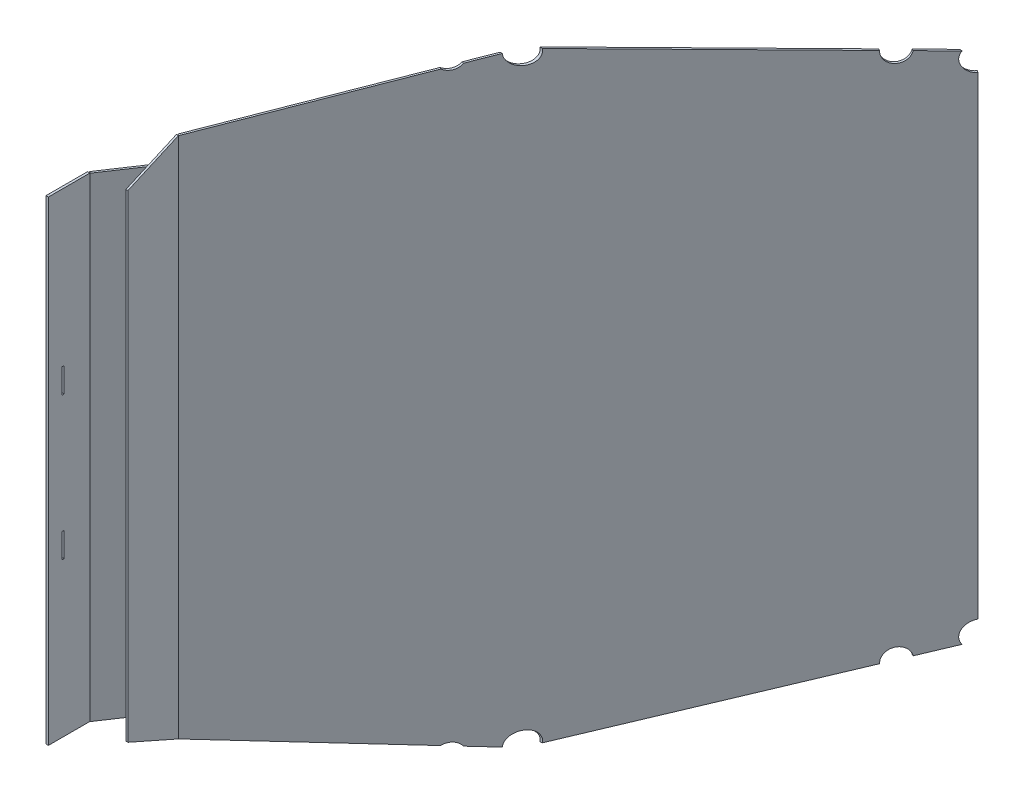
ISO-10303-21;
HEADER;
FILE_DESCRIPTION(('STEP AP214'),'2;1');
FILE_NAME('part.step','',(''),(''),'','','');
FILE_SCHEMA(('AUTOMOTIVE_DESIGN { 1 0 10303 214 1 1 1 1 }'));
ENDSEC;
DATA;
#1=APPLICATION_CONTEXT('core data for automotive mechanical design processes');
#2=APPLICATION_PROTOCOL_DEFINITION('international standard','automotive_design',2000,#1);
#3=PRODUCT_CONTEXT('',#1,'mechanical');
#4=PRODUCT('Part','Part','',(#3));
#5=PRODUCT_RELATED_PRODUCT_CATEGORY('part','',(#4));
#6=PRODUCT_DEFINITION_FORMATION('','',#4);
#7=PRODUCT_DEFINITION_CONTEXT('part definition',#1,'design');
#8=PRODUCT_DEFINITION('design','',#6,#7);
#9=PRODUCT_DEFINITION_SHAPE('','',#8);
#10=(LENGTH_UNIT() NAMED_UNIT(*) SI_UNIT(.MILLI.,.METRE.));
#11=(NAMED_UNIT(*) PLANE_ANGLE_UNIT() SI_UNIT($,.RADIAN.));
#12=(NAMED_UNIT(*) SI_UNIT($,.STERADIAN.) SOLID_ANGLE_UNIT());
#13=UNCERTAINTY_MEASURE_WITH_UNIT(LENGTH_MEASURE(1.E-05),#10,'distance_accuracy_value','');
#14=(GEOMETRIC_REPRESENTATION_CONTEXT(3) GLOBAL_UNCERTAINTY_ASSIGNED_CONTEXT((#13)) GLOBAL_UNIT_ASSIGNED_CONTEXT((#10,
#11,#12)) REPRESENTATION_CONTEXT('',''));
#15=CARTESIAN_POINT('',(0.,0.,0.));
#16=DIRECTION('',(0.,0.,1.));
#17=DIRECTION('',(1.,0.,0.));
#18=AXIS2_PLACEMENT_3D('',#15,#16,#17);
#19=CARTESIAN_POINT('',(-27.94,254.,581.556410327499));
#20=DIRECTION('',(0.,1.,0.));
#21=DIRECTION('',(0.,0.,1.));
#22=AXIS2_PLACEMENT_3D('',#19,#20,#21);
#23=PLANE('',#22);
#24=DIRECTION('',(0.,0.,1.));
#25=VECTOR('',#24,1.);
#26=CARTESIAN_POINT('',(-25.4,254.,581.556410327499));
#27=LINE('',#26,#25);
#28=CARTESIAN_POINT('',(-25.4,254.,581.556410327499));
#29=VERTEX_POINT('',#28);
#30=CARTESIAN_POINT('',(-25.4,254.,626.006410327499));
#31=VERTEX_POINT('',#30);
#32=EDGE_CURVE('E207',#29,#31,#27,.T.);
#33=ORIENTED_EDGE('',*,*,#32,.F.);
#34=DIRECTION('',(1.,0.,0.));
#35=VECTOR('',#34,1.);
#36=CARTESIAN_POINT('',(-27.94,254.,581.556410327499));
#37=LINE('',#36,#35);
#38=CARTESIAN_POINT('',(-27.94,254.,581.556410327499));
#39=VERTEX_POINT('',#38);
#40=EDGE_CURVE('E12',#39,#29,#37,.T.);
#41=ORIENTED_EDGE('',*,*,#40,.F.);
#42=DIRECTION('',(0.,0.,1.));
#43=VECTOR('',#42,1.);
#44=CARTESIAN_POINT('',(-27.94,254.,581.556410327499));
#45=LINE('',#44,#43);
#46=CARTESIAN_POINT('',(-27.94,254.,626.006410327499));
#47=VERTEX_POINT('',#46);
#48=EDGE_CURVE('E214',#39,#47,#45,.T.);
#49=ORIENTED_EDGE('',*,*,#48,.T.);
#50=DIRECTION('',(1.,0.,0.));
#51=VECTOR('',#50,1.);
#52=CARTESIAN_POINT('',(-27.94,254.,626.006410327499));
#53=LINE('',#52,#51);
#54=EDGE_CURVE('E59',#47,#31,#53,.T.);
#55=ORIENTED_EDGE('',*,*,#54,.T.);
#56=EDGE_LOOP('',(#33,#41,#49,#55));
#57=FACE_BOUND('',#56,.T.);
#58=ADVANCED_FACE('F56',(#57),#23,.T.);
#59=CARTESIAN_POINT('',(-27.94,254.,581.556410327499));
#60=DIRECTION('',(0.,0.,-1.));
#61=DIRECTION('',(-1.,0.,0.));
#62=AXIS2_PLACEMENT_3D('',#59,#60,#61);
#63=PLANE('',#62);
#64=DIRECTION('',(0.,1.,0.));
#65=VECTOR('',#64,1.);
#66=CARTESIAN_POINT('',(-25.4,254.,581.556410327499));
#67=LINE('',#66,#65);
#68=CARTESIAN_POINT('',(-25.4,-254.,581.556410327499));
#69=VERTEX_POINT('',#68);
#70=EDGE_CURVE('E218',#69,#29,#67,.T.);
#71=ORIENTED_EDGE('',*,*,#70,.F.);
#72=DIRECTION('',(1.,0.,0.));
#73=VECTOR('',#72,1.);
#74=CARTESIAN_POINT('',(-27.94,-254.,581.556410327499));
#75=LINE('',#74,#73);
#76=CARTESIAN_POINT('',(-27.94,-254.,581.556410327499));
#77=VERTEX_POINT('',#76);
#78=EDGE_CURVE('E64',#77,#69,#75,.T.);
#79=ORIENTED_EDGE('',*,*,#78,.F.);
#80=DIRECTION('',(0.,1.,0.));
#81=VECTOR('',#80,1.);
#82=CARTESIAN_POINT('',(-27.94,254.,581.556410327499));
#83=LINE('',#82,#81);
#84=EDGE_CURVE('E224',#77,#39,#83,.T.);
#85=ORIENTED_EDGE('',*,*,#84,.T.);
#86=ORIENTED_EDGE('',*,*,#40,.T.);
#87=EDGE_LOOP('',(#71,#79,#85,#86));
#88=FACE_BOUND('',#87,.T.);
#89=ADVANCED_FACE('F250',(#88),#63,.T.);
#90=CARTESIAN_POINT('',(-27.94,-254.,581.556410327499));
#91=DIRECTION('',(0.,-1.,0.));
#92=DIRECTION('',(0.,0.,-1.));
#93=AXIS2_PLACEMENT_3D('',#90,#91,#92);
#94=PLANE('',#93);
#95=DIRECTION('',(0.,0.,-1.));
#96=VECTOR('',#95,1.);
#97=CARTESIAN_POINT('',(-25.4,-254.,581.556410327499));
#98=LINE('',#97,#96);
#99=CARTESIAN_POINT('',(-25.4,-254.,626.006410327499));
#100=VERTEX_POINT('',#99);
#101=EDGE_CURVE('E232',#100,#69,#98,.T.);
#102=ORIENTED_EDGE('',*,*,#101,.F.);
#103=DIRECTION('',(1.,0.,0.));
#104=VECTOR('',#103,1.);
#105=CARTESIAN_POINT('',(-27.94,-254.,626.006410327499));
#106=LINE('',#105,#104);
#107=CARTESIAN_POINT('',(-27.94,-254.,626.006410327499));
#108=VERTEX_POINT('',#107);
#109=EDGE_CURVE('E237',#108,#100,#106,.T.);
#110=ORIENTED_EDGE('',*,*,#109,.F.);
#111=DIRECTION('',(0.,0.,-1.));
#112=VECTOR('',#111,1.);
#113=CARTESIAN_POINT('',(-27.94,-254.,581.556410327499));
#114=LINE('',#113,#112);
#115=EDGE_CURVE('E221',#108,#77,#114,.T.);
#116=ORIENTED_EDGE('',*,*,#115,.T.);
#117=ORIENTED_EDGE('',*,*,#78,.T.);
#118=EDGE_LOOP('',(#102,#110,#116,#117));
#119=FACE_BOUND('',#118,.T.);
#120=ADVANCED_FACE('F255',(#119),#94,.T.);
#121=CARTESIAN_POINT('',(-27.94,254.,626.006410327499));
#122=DIRECTION('',(0.,0.,1.));
#123=DIRECTION('',(0.,-1.,0.));
#124=AXIS2_PLACEMENT_3D('',#121,#122,#123);
#125=PLANE('',#124);
#126=DIRECTION('',(0.,-1.,0.));
#127=VECTOR('',#126,1.);
#128=CARTESIAN_POINT('',(-25.4,254.,626.006410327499));
#129=LINE('',#128,#127);
#130=EDGE_CURVE('E229',#31,#100,#129,.T.);
#131=ORIENTED_EDGE('',*,*,#130,.F.);
#132=ORIENTED_EDGE('',*,*,#54,.F.);
#133=DIRECTION('',(0.,-1.,0.));
#134=VECTOR('',#133,1.);
#135=CARTESIAN_POINT('',(-27.94,254.,626.006410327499));
#136=LINE('',#135,#134);
#137=EDGE_CURVE('E217',#47,#108,#136,.T.);
#138=ORIENTED_EDGE('',*,*,#137,.T.);
#139=ORIENTED_EDGE('',*,*,#109,.T.);
#140=EDGE_LOOP('',(#131,#132,#138,#139));
#141=FACE_BOUND('',#140,.T.);
#142=ADVANCED_FACE('F245',(#141),#125,.T.);
#143=CARTESIAN_POINT('',(-27.94,0.,0.));
#144=DIRECTION('',(1.,0.,0.));
#145=DIRECTION('',(0.,0.,-1.));
#146=AXIS2_PLACEMENT_3D('',#143,#144,#145);
#147=PLANE('',#146);
#148=DIRECTION('',(0.,0.,1.));
#149=VECTOR('',#148,1.);
#150=CARTESIAN_POINT('',(-27.94,-63.114804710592,611.678841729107));
#151=LINE('',#150,#149);
#152=CARTESIAN_POINT('',(-27.94,-63.114804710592,609.13264211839));
#153=VERTEX_POINT('',#152);
#154=CARTESIAN_POINT('',(-27.94,-63.114804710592,611.678841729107));
#155=VERTEX_POINT('',#154);
#156=EDGE_CURVE('E153',#153,#155,#151,.T.);
#157=ORIENTED_EDGE('',*,*,#156,.T.);
#158=DIRECTION('',(0.,-1.,0.));
#159=VECTOR('',#158,1.);
#160=CARTESIAN_POINT('',(-27.94,-89.3994191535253,611.678841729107));
#161=LINE('',#160,#159);
#162=CARTESIAN_POINT('',(-27.94,-89.3994191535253,611.678841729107));
#163=VERTEX_POINT('',#162);
#164=EDGE_CURVE('E147',#155,#163,#161,.T.);
#165=ORIENTED_EDGE('',*,*,#164,.T.);
#166=DIRECTION('',(0.,0.,-1.));
#167=VECTOR('',#166,1.);
#168=CARTESIAN_POINT('',(-27.94,-89.3994191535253,609.13264211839));
#169=LINE('',#168,#167);
#170=CARTESIAN_POINT('',(-27.94,-89.3994191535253,609.13264211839));
#171=VERTEX_POINT('',#170);
#172=EDGE_CURVE('E156',#163,#171,#169,.T.);
#173=ORIENTED_EDGE('',*,*,#172,.T.);
#174=DIRECTION('',(0.,1.,0.));
#175=VECTOR('',#174,1.);
#176=CARTESIAN_POINT('',(-27.94,-63.114804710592,609.13264211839));
#177=LINE('',#176,#175);
#178=EDGE_CURVE('E72',#171,#153,#177,.T.);
#179=ORIENTED_EDGE('',*,*,#178,.T.);
#180=EDGE_LOOP('',(#157,#165,#173,#179));
#181=FACE_BOUND('',#180,.T.);
#182=DIRECTION('',(0.,-1.,0.));
#183=VECTOR('',#182,1.);
#184=CARTESIAN_POINT('',(-27.94,89.3994191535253,611.678841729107));
#185=LINE('',#184,#183);
#186=CARTESIAN_POINT('',(-27.94,89.3994191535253,611.678841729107));
#187=VERTEX_POINT('',#186);
#188=CARTESIAN_POINT('',(-27.94,63.114804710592,611.678841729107));
#189=VERTEX_POINT('',#188);
#190=EDGE_CURVE('E192',#187,#189,#185,.T.);
#191=ORIENTED_EDGE('',*,*,#190,.T.);
#192=DIRECTION('',(0.,0.,-1.));
#193=VECTOR('',#192,1.);
#194=CARTESIAN_POINT('',(-27.94,63.114804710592,611.678841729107));
#195=LINE('',#194,#193);
#196=CARTESIAN_POINT('',(-27.94,63.114804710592,609.13264211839));
#197=VERTEX_POINT('',#196);
#198=EDGE_CURVE('E182',#189,#197,#195,.T.);
#199=ORIENTED_EDGE('',*,*,#198,.T.);
#200=DIRECTION('',(0.,1.,0.));
#201=VECTOR('',#200,1.);
#202=CARTESIAN_POINT('',(-27.94,63.114804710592,609.13264211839));
#203=LINE('',#202,#201);
#204=CARTESIAN_POINT('',(-27.94,89.3994191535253,609.13264211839));
#205=VERTEX_POINT('',#204);
#206=EDGE_CURVE('E185',#197,#205,#203,.T.);
#207=ORIENTED_EDGE('',*,*,#206,.T.);
#208=DIRECTION('',(0.,0.,1.));
#209=VECTOR('',#208,1.);
#210=CARTESIAN_POINT('',(-27.94,89.3994191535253,609.13264211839));
#211=LINE('',#210,#209);
#212=EDGE_CURVE('E189',#205,#187,#211,.T.);
#213=ORIENTED_EDGE('',*,*,#212,.T.);
#214=EDGE_LOOP('',(#191,#199,#207,#213));
#215=FACE_BOUND('',#214,.T.);
#216=ORIENTED_EDGE('',*,*,#48,.F.);
#217=ORIENTED_EDGE('',*,*,#84,.F.);
#218=ORIENTED_EDGE('',*,*,#115,.F.);
#219=ORIENTED_EDGE('',*,*,#137,.F.);
#220=EDGE_LOOP('',(#216,#217,#218,#219));
#221=FACE_BOUND('',#220,.T.);
#222=ADVANCED_FACE('F160',(#181,#215,#221),#147,.F.);
#223=CARTESIAN_POINT('',(-25.4,0.,0.));
#224=DIRECTION('',(1.,0.,0.));
#225=DIRECTION('',(0.,0.,-1.));
#226=AXIS2_PLACEMENT_3D('',#223,#224,#225);
#227=PLANE('',#226);
#228=DIRECTION('',(0.,-1.,0.));
#229=VECTOR('',#228,1.);
#230=CARTESIAN_POINT('',(-25.4,-89.3994191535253,611.678841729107));
#231=LINE('',#230,#229);
#232=CARTESIAN_POINT('',(-25.4,-63.114804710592,611.678841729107));
#233=VERTEX_POINT('',#232);
#234=CARTESIAN_POINT('',(-25.4,-89.3994191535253,611.678841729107));
#235=VERTEX_POINT('',#234);
#236=EDGE_CURVE('E80',#233,#235,#231,.T.);
#237=ORIENTED_EDGE('',*,*,#236,.F.);
#238=DIRECTION('',(0.,0.,1.));
#239=VECTOR('',#238,1.);
#240=CARTESIAN_POINT('',(-25.4,-63.114804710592,611.678841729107));
#241=LINE('',#240,#239);
#242=CARTESIAN_POINT('',(-25.4,-63.114804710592,609.13264211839));
#243=VERTEX_POINT('',#242);
#244=EDGE_CURVE('E163',#243,#233,#241,.T.);
#245=ORIENTED_EDGE('',*,*,#244,.F.);
#246=DIRECTION('',(0.,1.,0.));
#247=VECTOR('',#246,1.);
#248=CARTESIAN_POINT('',(-25.4,-63.114804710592,609.13264211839));
#249=LINE('',#248,#247);
#250=CARTESIAN_POINT('',(-25.4,-89.3994191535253,609.13264211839));
#251=VERTEX_POINT('',#250);
#252=EDGE_CURVE('E166',#251,#243,#249,.T.);
#253=ORIENTED_EDGE('',*,*,#252,.F.);
#254=DIRECTION('',(0.,0.,-1.));
#255=VECTOR('',#254,1.);
#256=CARTESIAN_POINT('',(-25.4,-89.3994191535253,609.13264211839));
#257=LINE('',#256,#255);
#258=EDGE_CURVE('E172',#235,#251,#257,.T.);
#259=ORIENTED_EDGE('',*,*,#258,.F.);
#260=EDGE_LOOP('',(#237,#245,#253,#259));
#261=FACE_BOUND('',#260,.T.);
#262=DIRECTION('',(0.,0.,-1.));
#263=VECTOR('',#262,1.);
#264=CARTESIAN_POINT('',(-25.4,63.114804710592,611.678841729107));
#265=LINE('',#264,#263);
#266=CARTESIAN_POINT('',(-25.4,63.114804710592,611.678841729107));
#267=VERTEX_POINT('',#266);
#268=CARTESIAN_POINT('',(-25.4,63.114804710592,609.13264211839));
#269=VERTEX_POINT('',#268);
#270=EDGE_CURVE('E178',#267,#269,#265,.T.);
#271=ORIENTED_EDGE('',*,*,#270,.F.);
#272=DIRECTION('',(0.,-1.,0.));
#273=VECTOR('',#272,1.);
#274=CARTESIAN_POINT('',(-25.4,89.3994191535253,611.678841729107));
#275=LINE('',#274,#273);
#276=CARTESIAN_POINT('',(-25.4,89.3994191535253,611.678841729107));
#277=VERTEX_POINT('',#276);
#278=EDGE_CURVE('E186',#277,#267,#275,.T.);
#279=ORIENTED_EDGE('',*,*,#278,.F.);
#280=DIRECTION('',(0.,0.,1.));
#281=VECTOR('',#280,1.);
#282=CARTESIAN_POINT('',(-25.4,89.3994191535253,609.13264211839));
#283=LINE('',#282,#281);
#284=CARTESIAN_POINT('',(-25.4,89.3994191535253,609.13264211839));
#285=VERTEX_POINT('',#284);
#286=EDGE_CURVE('E200',#285,#277,#283,.T.);
#287=ORIENTED_EDGE('',*,*,#286,.F.);
#288=DIRECTION('',(0.,1.,0.));
#289=VECTOR('',#288,1.);
#290=CARTESIAN_POINT('',(-25.4,63.114804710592,609.13264211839));
#291=LINE('',#290,#289);
#292=EDGE_CURVE('E197',#269,#285,#291,.T.);
#293=ORIENTED_EDGE('',*,*,#292,.F.);
#294=EDGE_LOOP('',(#271,#279,#287,#293));
#295=FACE_BOUND('',#294,.T.);
#296=ORIENTED_EDGE('',*,*,#32,.T.);
#297=ORIENTED_EDGE('',*,*,#130,.T.);
#298=ORIENTED_EDGE('',*,*,#101,.T.);
#299=ORIENTED_EDGE('',*,*,#70,.T.);
#300=EDGE_LOOP('',(#296,#297,#298,#299));
#301=FACE_BOUND('',#300,.T.);
#302=ADVANCED_FACE('F247',(#261,#295,#301),#227,.T.);
#303=CARTESIAN_POINT('',(-27.94,63.114804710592,611.678841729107));
#304=DIRECTION('',(0.,-1.,0.));
#305=DIRECTION('',(0.,0.,-1.));
#306=AXIS2_PLACEMENT_3D('',#303,#304,#305);
#307=PLANE('',#306);
#308=ORIENTED_EDGE('',*,*,#270,.T.);
#309=DIRECTION('',(1.,0.,0.));
#310=VECTOR('',#309,1.);
#311=CARTESIAN_POINT('',(-27.94,63.114804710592,609.13264211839));
#312=LINE('',#311,#310);
#313=EDGE_CURVE('E195',#197,#269,#312,.T.);
#314=ORIENTED_EDGE('',*,*,#313,.F.);
#315=ORIENTED_EDGE('',*,*,#198,.F.);
#316=DIRECTION('',(1.,0.,0.));
#317=VECTOR('',#316,1.);
#318=CARTESIAN_POINT('',(-27.94,63.114804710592,611.678841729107));
#319=LINE('',#318,#317);
#320=EDGE_CURVE('E205',#189,#267,#319,.T.);
#321=ORIENTED_EDGE('',*,*,#320,.T.);
#322=EDGE_LOOP('',(#308,#314,#315,#321));
#323=FACE_BOUND('',#322,.T.);
#324=ADVANCED_FACE('F299',(#323),#307,.F.);
#325=CARTESIAN_POINT('',(-27.94,89.3994191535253,611.678841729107));
#326=DIRECTION('',(0.,0.,1.));
#327=DIRECTION('',(1.,0.,0.));
#328=AXIS2_PLACEMENT_3D('',#325,#326,#327);
#329=PLANE('',#328);
#330=ORIENTED_EDGE('',*,*,#278,.T.);
#331=ORIENTED_EDGE('',*,*,#320,.F.);
#332=ORIENTED_EDGE('',*,*,#190,.F.);
#333=DIRECTION('',(1.,0.,0.));
#334=VECTOR('',#333,1.);
#335=CARTESIAN_POINT('',(-27.94,89.3994191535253,611.678841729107));
#336=LINE('',#335,#334);
#337=EDGE_CURVE('E208',#187,#277,#336,.T.);
#338=ORIENTED_EDGE('',*,*,#337,.T.);
#339=EDGE_LOOP('',(#330,#331,#332,#338));
#340=FACE_BOUND('',#339,.T.);
#341=ADVANCED_FACE('F309',(#340),#329,.F.);
#342=CARTESIAN_POINT('',(-27.94,89.3994191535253,609.13264211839));
#343=DIRECTION('',(0.,1.,0.));
#344=DIRECTION('',(0.,0.,1.));
#345=AXIS2_PLACEMENT_3D('',#342,#343,#344);
#346=PLANE('',#345);
#347=ORIENTED_EDGE('',*,*,#286,.T.);
#348=ORIENTED_EDGE('',*,*,#337,.F.);
#349=ORIENTED_EDGE('',*,*,#212,.F.);
#350=DIRECTION('',(1.,0.,0.));
#351=VECTOR('',#350,1.);
#352=CARTESIAN_POINT('',(-27.94,89.3994191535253,609.13264211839));
#353=LINE('',#352,#351);
#354=EDGE_CURVE('E210',#205,#285,#353,.T.);
#355=ORIENTED_EDGE('',*,*,#354,.T.);
#356=EDGE_LOOP('',(#347,#348,#349,#355));
#357=FACE_BOUND('',#356,.T.);
#358=ADVANCED_FACE('F319',(#357),#346,.F.);
#359=CARTESIAN_POINT('',(-27.94,63.114804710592,609.13264211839));
#360=DIRECTION('',(0.,0.,-1.));
#361=DIRECTION('',(-1.,0.,0.));
#362=AXIS2_PLACEMENT_3D('',#359,#360,#361);
#363=PLANE('',#362);
#364=ORIENTED_EDGE('',*,*,#292,.T.);
#365=ORIENTED_EDGE('',*,*,#354,.F.);
#366=ORIENTED_EDGE('',*,*,#206,.F.);
#367=ORIENTED_EDGE('',*,*,#313,.T.);
#368=EDGE_LOOP('',(#364,#365,#366,#367));
#369=FACE_BOUND('',#368,.T.);
#370=ADVANCED_FACE('F329',(#369),#363,.F.);
#371=CARTESIAN_POINT('',(-27.94,-89.3994191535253,611.678841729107));
#372=DIRECTION('',(0.,0.,1.));
#373=DIRECTION('',(1.,0.,0.));
#374=AXIS2_PLACEMENT_3D('',#371,#372,#373);
#375=PLANE('',#374);
#376=ORIENTED_EDGE('',*,*,#236,.T.);
#377=DIRECTION('',(1.,0.,0.));
#378=VECTOR('',#377,1.);
#379=CARTESIAN_POINT('',(-27.94,-89.3994191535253,611.678841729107));
#380=LINE('',#379,#378);
#381=EDGE_CURVE('E143',#163,#235,#380,.T.);
#382=ORIENTED_EDGE('',*,*,#381,.F.);
#383=ORIENTED_EDGE('',*,*,#164,.F.);
#384=DIRECTION('',(1.,0.,0.));
#385=VECTOR('',#384,1.);
#386=CARTESIAN_POINT('',(-27.94,-63.114804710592,611.678841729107));
#387=LINE('',#386,#385);
#388=EDGE_CURVE('E176',#155,#233,#387,.T.);
#389=ORIENTED_EDGE('',*,*,#388,.T.);
#390=EDGE_LOOP('',(#376,#382,#383,#389));
#391=FACE_BOUND('',#390,.T.);
#392=ADVANCED_FACE('F145',(#391),#375,.F.);
#393=CARTESIAN_POINT('',(-27.94,-63.114804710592,611.678841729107));
#394=DIRECTION('',(0.,1.,0.));
#395=DIRECTION('',(0.,0.,1.));
#396=AXIS2_PLACEMENT_3D('',#393,#394,#395);
#397=PLANE('',#396);
#398=ORIENTED_EDGE('',*,*,#244,.T.);
#399=ORIENTED_EDGE('',*,*,#388,.F.);
#400=ORIENTED_EDGE('',*,*,#156,.F.);
#401=DIRECTION('',(1.,0.,0.));
#402=VECTOR('',#401,1.);
#403=CARTESIAN_POINT('',(-27.94,-63.114804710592,609.13264211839));
#404=LINE('',#403,#402);
#405=EDGE_CURVE('E179',#153,#243,#404,.T.);
#406=ORIENTED_EDGE('',*,*,#405,.T.);
#407=EDGE_LOOP('',(#398,#399,#400,#406));
#408=FACE_BOUND('',#407,.T.);
#409=ADVANCED_FACE('F348',(#408),#397,.F.);
#410=CARTESIAN_POINT('',(-27.94,-63.114804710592,609.13264211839));
#411=DIRECTION('',(0.,0.,-1.));
#412=DIRECTION('',(-1.,0.,0.));
#413=AXIS2_PLACEMENT_3D('',#410,#411,#412);
#414=PLANE('',#413);
#415=ORIENTED_EDGE('',*,*,#252,.T.);
#416=ORIENTED_EDGE('',*,*,#405,.F.);
#417=ORIENTED_EDGE('',*,*,#178,.F.);
#418=DIRECTION('',(1.,0.,0.));
#419=VECTOR('',#418,1.);
#420=CARTESIAN_POINT('',(-27.94,-89.3994191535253,609.13264211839));
#421=LINE('',#420,#419);
#422=EDGE_CURVE('E152',#171,#251,#421,.T.);
#423=ORIENTED_EDGE('',*,*,#422,.T.);
#424=EDGE_LOOP('',(#415,#416,#417,#423));
#425=FACE_BOUND('',#424,.T.);
#426=ADVANCED_FACE('F357',(#425),#414,.F.);
#427=CARTESIAN_POINT('',(-27.94,-89.3994191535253,609.13264211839));
#428=DIRECTION('',(0.,-1.,0.));
#429=DIRECTION('',(0.,0.,-1.));
#430=AXIS2_PLACEMENT_3D('',#427,#428,#429);
#431=PLANE('',#430);
#432=ORIENTED_EDGE('',*,*,#258,.T.);
#433=ORIENTED_EDGE('',*,*,#422,.F.);
#434=ORIENTED_EDGE('',*,*,#172,.F.);
#435=ORIENTED_EDGE('',*,*,#381,.T.);
#436=EDGE_LOOP('',(#432,#433,#434,#435));
#437=FACE_BOUND('',#436,.T.);
#438=ADVANCED_FACE('F157',(#437),#431,.F.);
#439=CLOSED_SHELL('',(#58,#89,#120,#142,#222,#302,#324,#341,#358,#370,#392,#409,#426,#438));
#440=MANIFOLD_SOLID_BREP('B2',#439);
#441=CARTESIAN_POINT('',(10.5410000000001,0.,525.07591607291));
#442=DIRECTION('',(0.,0.,-1.));
#443=DIRECTION('',(-1.,0.,0.));
#444=AXIS2_PLACEMENT_3D('',#441,#442,#443);
#445=PLANE('',#444);
#446=DIRECTION('',(0.,1.,0.));
#447=VECTOR('',#446,1.);
#448=CARTESIAN_POINT('',(12.7000000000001,0.,525.07591607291));
#449=LINE('',#448,#447);
#450=CARTESIAN_POINT('',(12.7000000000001,-279.4,525.07591607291));
#451=VERTEX_POINT('',#450);
#452=CARTESIAN_POINT('',(12.7000000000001,279.4,525.07591607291));
#453=VERTEX_POINT('',#452);
#454=EDGE_CURVE('E464',#451,#453,#449,.T.);
#455=ORIENTED_EDGE('',*,*,#454,.F.);
#456=DIRECTION('',(1.,0.,0.));
#457=VECTOR('',#456,1.);
#458=CARTESIAN_POINT('',(10.5410000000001,-279.4,525.07591607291));
#459=LINE('',#458,#457);
#460=CARTESIAN_POINT('',(10.5410000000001,-279.4,525.07591607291));
#461=VERTEX_POINT('',#460);
#462=EDGE_CURVE('E54',#461,#451,#459,.T.);
#463=ORIENTED_EDGE('',*,*,#462,.F.);
#464=DIRECTION('',(0.,1.,0.));
#465=VECTOR('',#464,1.);
#466=CARTESIAN_POINT('',(10.5410000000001,0.,525.07591607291));
#467=LINE('',#466,#465);
#468=CARTESIAN_POINT('',(10.5410000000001,279.4,525.07591607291));
#469=VERTEX_POINT('',#468);
#470=EDGE_CURVE('E449',#461,#469,#467,.T.);
#471=ORIENTED_EDGE('',*,*,#470,.T.);
#472=DIRECTION('',(1.,0.,0.));
#473=VECTOR('',#472,1.);
#474=CARTESIAN_POINT('',(10.5410000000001,279.4,525.07591607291));
#475=LINE('',#474,#473);
#476=EDGE_CURVE('E417',#469,#453,#475,.T.);
#477=ORIENTED_EDGE('',*,*,#476,.T.);
#478=EDGE_LOOP('',(#455,#463,#471,#477));
#479=FACE_BOUND('',#478,.T.);
#480=ADVANCED_FACE('F401',(#479),#445,.T.);
#481=CARTESIAN_POINT('',(10.5410000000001,-427.919359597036,189.244914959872));
#482=DIRECTION('',(0.,0.914556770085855,-0.404457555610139));
#483=DIRECTION('',(0.,0.404457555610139,0.914556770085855));
#484=AXIS2_PLACEMENT_3D('',#481,#482,#483);
#485=PLANE('',#484);
#486=DIRECTION('',(0.,0.404457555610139,0.914556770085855));
#487=VECTOR('',#486,1.);
#488=CARTESIAN_POINT('',(12.7000000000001,-427.919359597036,189.244914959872));
#489=LINE('',#488,#487);
#490=CARTESIAN_POINT('',(12.7000000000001,-255.529861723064,579.050916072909));
#491=VERTEX_POINT('',#490);
#492=EDGE_CURVE('E455',#451,#491,#489,.T.);
#493=ORIENTED_EDGE('',*,*,#492,.T.);
#494=DIRECTION('',(1.,0.,0.));
#495=VECTOR('',#494,1.);
#496=CARTESIAN_POINT('',(10.5410000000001,-255.529861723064,579.050916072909));
#497=LINE('',#496,#495);
#498=CARTESIAN_POINT('',(10.5410000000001,-255.529861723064,579.050916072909));
#499=VERTEX_POINT('',#498);
#500=EDGE_CURVE('E409',#499,#491,#497,.T.);
#501=ORIENTED_EDGE('',*,*,#500,.F.);
#502=DIRECTION('',(0.,0.404457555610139,0.914556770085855));
#503=VECTOR('',#502,1.);
#504=CARTESIAN_POINT('',(10.5410000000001,-427.919359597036,189.244914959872));
#505=LINE('',#504,#503);
#506=EDGE_CURVE('E443',#461,#499,#505,.T.);
#507=ORIENTED_EDGE('',*,*,#506,.F.);
#508=ORIENTED_EDGE('',*,*,#462,.T.);
#509=EDGE_LOOP('',(#493,#501,#507,#508));
#510=FACE_BOUND('',#509,.T.);
#511=ADVANCED_FACE('F453',(#510),#485,.F.);
#512=CARTESIAN_POINT('',(10.5410000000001,1.25792667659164E-13,579.050916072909));
#513=DIRECTION('',(0.,0.,1.));
#514=DIRECTION('',(0.,-1.,0.));
#515=AXIS2_PLACEMENT_3D('',#512,#513,#514);
#516=PLANE('',#515);
#517=DIRECTION('',(0.,-1.,0.));
#518=VECTOR('',#517,1.);
#519=CARTESIAN_POINT('',(12.7000000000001,1.25792667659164E-13,579.050916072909));
#520=LINE('',#519,#518);
#521=CARTESIAN_POINT('',(12.7000000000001,255.529861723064,579.050916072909));
#522=VERTEX_POINT('',#521);
#523=EDGE_CURVE('E467',#522,#491,#520,.T.);
#524=ORIENTED_EDGE('',*,*,#523,.F.);
#525=DIRECTION('',(1.,0.,0.));
#526=VECTOR('',#525,1.);
#527=CARTESIAN_POINT('',(10.5410000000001,255.529861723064,579.050916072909));
#528=LINE('',#527,#526);
#529=CARTESIAN_POINT('',(10.5410000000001,255.529861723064,579.050916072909));
#530=VERTEX_POINT('',#529);
#531=EDGE_CURVE('E430',#530,#522,#528,.T.);
#532=ORIENTED_EDGE('',*,*,#531,.F.);
#533=DIRECTION('',(0.,-1.,0.));
#534=VECTOR('',#533,1.);
#535=CARTESIAN_POINT('',(10.5410000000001,1.25792667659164E-13,579.050916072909));
#536=LINE('',#535,#534);
#537=EDGE_CURVE('E448',#530,#499,#536,.T.);
#538=ORIENTED_EDGE('',*,*,#537,.T.);
#539=ORIENTED_EDGE('',*,*,#500,.T.);
#540=EDGE_LOOP('',(#524,#532,#538,#539));
#541=FACE_BOUND('',#540,.T.);
#542=ADVANCED_FACE('F458',(#541),#516,.T.);
#543=CARTESIAN_POINT('',(10.5410000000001,427.919359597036,189.244914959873));
#544=DIRECTION('',(0.,0.914556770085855,0.404457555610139));
#545=DIRECTION('',(0.,-0.404457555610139,0.914556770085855));
#546=AXIS2_PLACEMENT_3D('',#543,#544,#545);
#547=PLANE('',#546);
#548=DIRECTION('',(0.,-0.40445755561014,0.914556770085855));
#549=VECTOR('',#548,1.);
#550=CARTESIAN_POINT('',(12.7000000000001,427.919359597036,189.244914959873));
#551=LINE('',#550,#549);
#552=EDGE_CURVE('E469',#453,#522,#551,.T.);
#553=ORIENTED_EDGE('',*,*,#552,.F.);
#554=ORIENTED_EDGE('',*,*,#476,.F.);
#555=DIRECTION('',(0.,-0.40445755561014,0.914556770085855));
#556=VECTOR('',#555,1.);
#557=CARTESIAN_POINT('',(10.5410000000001,427.919359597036,189.244914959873));
#558=LINE('',#557,#556);
#559=EDGE_CURVE('E459',#469,#530,#558,.T.);
#560=ORIENTED_EDGE('',*,*,#559,.T.);
#561=ORIENTED_EDGE('',*,*,#531,.T.);
#562=EDGE_LOOP('',(#553,#554,#560,#561));
#563=FACE_BOUND('',#562,.T.);
#564=ADVANCED_FACE('F474',(#563),#547,.T.);
#565=CARTESIAN_POINT('',(10.5410000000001,0.,0.));
#566=DIRECTION('',(-1.,0.,0.));
#567=DIRECTION('',(0.,0.,1.));
#568=AXIS2_PLACEMENT_3D('',#565,#566,#567);
#569=PLANE('',#568);
#570=ORIENTED_EDGE('',*,*,#470,.F.);
#571=ORIENTED_EDGE('',*,*,#506,.T.);
#572=ORIENTED_EDGE('',*,*,#537,.F.);
#573=ORIENTED_EDGE('',*,*,#559,.F.);
#574=EDGE_LOOP('',(#570,#571,#572,#573));
#575=FACE_BOUND('',#574,.T.);
#576=ADVANCED_FACE('F445',(#575),#569,.T.);
#577=CARTESIAN_POINT('',(12.7000000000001,0.,0.));
#578=DIRECTION('',(-1.,0.,0.));
#579=DIRECTION('',(0.,0.,1.));
#580=AXIS2_PLACEMENT_3D('',#577,#578,#579);
#581=PLANE('',#580);
#582=ORIENTED_EDGE('',*,*,#454,.T.);
#583=ORIENTED_EDGE('',*,*,#552,.T.);
#584=ORIENTED_EDGE('',*,*,#523,.T.);
#585=ORIENTED_EDGE('',*,*,#492,.F.);
#586=EDGE_LOOP('',(#582,#583,#584,#585));
#587=FACE_BOUND('',#586,.T.);
#588=ADVANCED_FACE('F481',(#587),#581,.F.);
#589=CLOSED_SHELL('',(#480,#511,#542,#564,#576,#588));
#590=MANIFOLD_SOLID_BREP('B6',#589);
#591=CARTESIAN_POINT('',(217.78075440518,-341.812437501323,214.772548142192));
#592=DIRECTION('',(-0.0920442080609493,-0.986211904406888,0.137527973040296));
#593=DIRECTION('',(0.,-0.138114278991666,-0.990416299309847));
#594=AXIS2_PLACEMENT_3D('',#591,#592,#593);
#595=PLANE('',#594);
#596=CARTESIAN_POINT('',(180.084004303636,-316.675903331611,369.796877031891));
#597=DIRECTION('',(-0.0920442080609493,-0.986211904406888,0.137527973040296));
#598=DIRECTION('',(0.929484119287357,-0.035551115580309,0.367144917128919));
#599=AXIS2_PLACEMENT_3D('',#596,#597,#598);
#600=ELLIPSE('',#599,73.4026636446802,12.954);
#601=CARTESIAN_POINT('',(125.171787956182,-313.331789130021,357.026047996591));
#602=VERTEX_POINT('',#601);
#603=CARTESIAN_POINT('',(123.373881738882,-313.330680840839,355.830699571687));
#604=VERTEX_POINT('',#603);
#605=EDGE_CURVE('E679',#602,#604,#600,.T.);
#606=ORIENTED_EDGE('',*,*,#605,.F.);
#607=DIRECTION('',(0.548531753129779,-0.165487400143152,-0.819589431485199));
#608=VECTOR('',#607,1.);
#609=CARTESIAN_POINT('',(219.574987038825,-341.812437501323,215.973385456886));
#610=LINE('',#609,#608);
#611=CARTESIAN_POINT('',(12.7000000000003,-279.4,525.07591607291));
#612=VERTEX_POINT('',#611);
#613=EDGE_CURVE('E687',#612,#602,#610,.T.);
#614=ORIENTED_EDGE('',*,*,#613,.F.);
#615=DIRECTION('',(0.831048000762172,0.,0.55620070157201));
#616=VECTOR('',#615,1.);
#617=CARTESIAN_POINT('',(10.9057673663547,-279.4,523.875078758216));
#618=LINE('',#617,#616);
#619=CARTESIAN_POINT('',(10.9057673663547,-279.4,523.875078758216));
#620=VERTEX_POINT('',#619);
#621=EDGE_CURVE('E718',#620,#612,#618,.T.);
#622=ORIENTED_EDGE('',*,*,#621,.F.);
#623=DIRECTION('',(0.548531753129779,-0.165487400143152,-0.819589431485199));
#624=VECTOR('',#623,1.);
#625=CARTESIAN_POINT('',(217.78075440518,-341.812437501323,214.772548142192));
#626=LINE('',#625,#624);
#627=EDGE_CURVE('E689',#620,#604,#626,.T.);
#628=ORIENTED_EDGE('',*,*,#627,.T.);
#629=EDGE_LOOP('',(#606,#614,#622,#628));
#630=FACE_BOUND('',#629,.T.);
#631=ADVANCED_FACE('F531',(#630),#595,.T.);
#632=CARTESIAN_POINT('',(273.305054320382,-293.960977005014,131.810843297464));
#633=DIRECTION('',(-0.0795337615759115,0.989723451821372,0.118835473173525));
#634=DIRECTION('',(0.,-0.1192131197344,0.992868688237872));
#635=AXIS2_PLACEMENT_3D('',#632,#633,#634);
#636=PLANE('',#635);
#637=DIRECTION('',(-0.550484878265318,-0.142994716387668,0.822507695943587));
#638=VECTOR('',#637,1.);
#639=CARTESIAN_POINT('',(275.099286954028,-293.960977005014,133.011680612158));
#640=LINE('',#639,#638);
#641=CARTESIAN_POINT('',(348.785125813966,-274.820241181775,22.9138887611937));
#642=VERTEX_POINT('',#641);
#643=CARTESIAN_POINT('',(327.80523946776,-280.270005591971,54.2610131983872));
#644=VERTEX_POINT('',#643);
#645=EDGE_CURVE('E700',#642,#644,#640,.T.);
#646=ORIENTED_EDGE('',*,*,#645,.T.);
#647=CARTESIAN_POINT('',(333.441864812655,-281.820955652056,70.9505892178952));
#648=DIRECTION('',(-0.0795337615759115,0.989723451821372,0.118835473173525));
#649=DIRECTION('',(0.90767615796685,0.0226240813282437,0.419061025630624));
#650=AXIS2_PLACEMENT_3D('',#647,#648,#649);
#651=ELLIPSE('',#650,165.338648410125,12.954);
#652=CARTESIAN_POINT('',(325.81292932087,-280.321458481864,53.3561336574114));
#653=VERTEX_POINT('',#652);
#654=EDGE_CURVE('E834',#644,#653,#651,.T.);
#655=ORIENTED_EDGE('',*,*,#654,.T.);
#656=DIRECTION('',(-0.550484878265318,-0.142994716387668,0.822507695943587));
#657=VECTOR('',#656,1.);
#658=CARTESIAN_POINT('',(273.305054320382,-293.960977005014,131.810843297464));
#659=LINE('',#658,#657);
#660=CARTESIAN_POINT('',(346.192891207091,-275.027531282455,22.9053871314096));
#661=VERTEX_POINT('',#660);
#662=EDGE_CURVE('E777',#661,#653,#659,.T.);
#663=ORIENTED_EDGE('',*,*,#662,.F.);
#664=CARTESIAN_POINT('',(296.864587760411,-277.246265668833,8.36989513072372));
#665=DIRECTION('',(-0.0795337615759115,0.989723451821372,0.118835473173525));
#666=DIRECTION('',(0.995554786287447,0.072832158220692,0.0597172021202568));
#667=AXIS2_PLACEMENT_3D('',#664,#665,#666);
#668=ELLIPSE('',#667,114.450133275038,12.954);
#669=EDGE_CURVE('E829',#661,#642,#668,.T.);
#670=ORIENTED_EDGE('',*,*,#669,.T.);
#671=EDGE_LOOP('',(#646,#655,#663,#670));
#672=FACE_BOUND('',#671,.T.);
#673=ADVANCED_FACE('F861',(#672),#636,.F.);
#674=CARTESIAN_POINT('',(217.78075440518,341.812437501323,214.772548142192));
#675=DIRECTION('',(0.0920442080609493,-0.986211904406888,-0.137527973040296));
#676=DIRECTION('',(0.,0.138114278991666,-0.990416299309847));
#677=AXIS2_PLACEMENT_3D('',#674,#675,#676);
#678=PLANE('',#677);
#679=CARTESIAN_POINT('',(180.084004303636,316.675903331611,369.796877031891));
#680=DIRECTION('',(0.0920442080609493,-0.986211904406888,-0.137527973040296));
#681=DIRECTION('',(0.929484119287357,0.035551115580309,0.367144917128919));
#682=AXIS2_PLACEMENT_3D('',#679,#680,#681);
#683=ELLIPSE('',#682,73.4026636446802,12.954);
#684=CARTESIAN_POINT('',(135.029482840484,316.305772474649,342.297160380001));
#685=VERTEX_POINT('',#684);
#686=CARTESIAN_POINT('',(132.734915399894,316.154825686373,341.843898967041));
#687=VERTEX_POINT('',#686);
#688=EDGE_CURVE('E822',#685,#687,#683,.F.);
#689=ORIENTED_EDGE('',*,*,#688,.F.);
#690=DIRECTION('',(0.548531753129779,0.165487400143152,-0.819589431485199));
#691=VECTOR('',#690,1.);
#692=CARTESIAN_POINT('',(219.574987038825,341.812437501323,215.973385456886));
#693=LINE('',#692,#691);
#694=CARTESIAN_POINT('',(151.584505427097,321.300283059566,317.561451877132));
#695=VERTEX_POINT('',#694);
#696=EDGE_CURVE('E762',#685,#695,#693,.T.);
#697=ORIENTED_EDGE('',*,*,#696,.T.);
#698=CARTESIAN_POINT('',(147.589152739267,322.730018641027,304.634835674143));
#699=DIRECTION('',(0.0920442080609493,-0.986211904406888,-0.137527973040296));
#700=DIRECTION('',(0.995554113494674,0.0883700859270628,0.0325996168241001));
#701=AXIS2_PLACEMENT_3D('',#698,#699,#700);
#702=ELLIPSE('',#701,56.5707851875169,12.954);
#703=CARTESIAN_POINT('',(149.022082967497,321.068526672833,317.508406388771));
#704=VERTEX_POINT('',#703);
#705=EDGE_CURVE('E816',#704,#695,#702,.F.);
#706=ORIENTED_EDGE('',*,*,#705,.F.);
#707=DIRECTION('',(0.548531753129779,0.165487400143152,-0.819589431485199));
#708=VECTOR('',#707,1.);
#709=CARTESIAN_POINT('',(217.78075440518,341.812437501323,214.772548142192));
#710=LINE('',#709,#708);
#711=EDGE_CURVE('E790',#687,#704,#710,.T.);
#712=ORIENTED_EDGE('',*,*,#711,.F.);
#713=EDGE_LOOP('',(#689,#697,#706,#712));
#714=FACE_BOUND('',#713,.T.);
#715=ADVANCED_FACE('F867',(#714),#678,.F.);
#716=CARTESIAN_POINT('',(273.305054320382,293.960977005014,131.810843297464));
#717=DIRECTION('',(0.0795337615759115,0.989723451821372,-0.118835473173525));
#718=DIRECTION('',(0.,0.1192131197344,0.992868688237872));
#719=AXIS2_PLACEMENT_3D('',#716,#717,#718);
#720=PLANE('',#719);
#721=DIRECTION('',(-0.550484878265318,0.142994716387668,0.822507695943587));
#722=VECTOR('',#721,1.);
#723=CARTESIAN_POINT('',(273.305054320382,293.960977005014,131.810843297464));
#724=LINE('',#723,#722);
#725=CARTESIAN_POINT('',(311.440797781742,284.05478332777,74.8302726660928));
#726=VERTEX_POINT('',#725);
#727=CARTESIAN_POINT('',(166.233377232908,321.774064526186,291.792128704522));
#728=VERTEX_POINT('',#727);
#729=EDGE_CURVE('E786',#726,#728,#724,.T.);
#730=ORIENTED_EDGE('',*,*,#729,.T.);
#731=CARTESIAN_POINT('',(113.344182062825,327.565232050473,304.626492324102));
#732=DIRECTION('',(0.0795337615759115,0.989723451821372,-0.118835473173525));
#733=DIRECTION('',(0.996697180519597,-0.0809177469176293,-0.00685919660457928));
#734=AXIS2_PLACEMENT_3D('',#731,#732,#733);
#735=ELLIPSE('',#734,217.176234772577,12.954);
#736=CARTESIAN_POINT('',(168.816536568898,321.569131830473,291.814190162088));
#737=VERTEX_POINT('',#736);
#738=EDGE_CURVE('E813',#728,#737,#735,.F.);
#739=ORIENTED_EDGE('',*,*,#738,.T.);
#740=DIRECTION('',(-0.550484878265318,0.142994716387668,0.822507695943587));
#741=VECTOR('',#740,1.);
#742=CARTESIAN_POINT('',(275.099286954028,293.960977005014,133.011680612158));
#743=LINE('',#742,#741);
#744=CARTESIAN_POINT('',(313.415431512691,284.007922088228,75.7615634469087));
#745=VERTEX_POINT('',#744);
#746=EDGE_CURVE('E756',#745,#737,#743,.T.);
#747=ORIENTED_EDGE('',*,*,#746,.F.);
#748=CARTESIAN_POINT('',(333.441864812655,281.820955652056,70.9505892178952));
#749=DIRECTION('',(0.0795337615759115,0.989723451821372,-0.118835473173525));
#750=DIRECTION('',(0.90767615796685,-0.0226240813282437,0.419061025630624));
#751=AXIS2_PLACEMENT_3D('',#748,#749,#750);
#752=ELLIPSE('',#751,165.338648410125,12.954);
#753=EDGE_CURVE('E806',#745,#726,#752,.F.);
#754=ORIENTED_EDGE('',*,*,#753,.T.);
#755=EDGE_LOOP('',(#730,#739,#747,#754));
#756=FACE_BOUND('',#755,.T.);
#757=ADVANCED_FACE('F892',(#756),#720,.T.);
#758=CARTESIAN_POINT('',(249.682473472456,254.,167.10655315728));
#759=DIRECTION('',(0.,1.,0.));
#760=DIRECTION('',(0.,0.,1.));
#761=AXIS2_PLACEMENT_3D('',#758,#759,#760);
#762=PLANE('',#761);
#763=DIRECTION('',(-0.55620070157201,0.,0.831048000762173));
#764=VECTOR('',#763,1.);
#765=CARTESIAN_POINT('',(251.476706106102,254.,168.307390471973));
#766=LINE('',#765,#764);
#767=CARTESIAN_POINT('',(12.7000000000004,254.,525.07591607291));
#768=VERTEX_POINT('',#767);
#769=CARTESIAN_POINT('',(-25.1010542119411,254.,581.556410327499));
#770=VERTEX_POINT('',#769);
#771=EDGE_CURVE('E765',#768,#770,#766,.T.);
#772=ORIENTED_EDGE('',*,*,#771,.F.);
#773=DIRECTION('',(0.831048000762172,0.,0.55620070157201));
#774=VECTOR('',#773,1.);
#775=CARTESIAN_POINT('',(10.9057673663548,254.,523.875078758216));
#776=LINE('',#775,#774);
#777=CARTESIAN_POINT('',(10.9057673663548,254.,523.875078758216));
#778=VERTEX_POINT('',#777);
#779=EDGE_CURVE('E723',#778,#768,#776,.T.);
#780=ORIENTED_EDGE('',*,*,#779,.F.);
#781=DIRECTION('',(-0.55620070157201,0.,0.831048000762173));
#782=VECTOR('',#781,1.);
#783=CARTESIAN_POINT('',(249.682473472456,254.,167.10655315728));
#784=LINE('',#783,#782);
#785=CARTESIAN_POINT('',(-26.8952868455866,254.,580.355573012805));
#786=VERTEX_POINT('',#785);
#787=EDGE_CURVE('E709',#778,#786,#784,.T.);
#788=ORIENTED_EDGE('',*,*,#787,.T.);
#789=DIRECTION('',(0.831048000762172,0.,0.55620070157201));
#790=VECTOR('',#789,1.);
#791=CARTESIAN_POINT('',(-26.8952868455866,254.,580.355573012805));
#792=LINE('',#791,#790);
#793=EDGE_CURVE('E710',#786,#770,#792,.T.);
#794=ORIENTED_EDGE('',*,*,#793,.T.);
#795=EDGE_LOOP('',(#772,#780,#788,#794));
#796=FACE_BOUND('',#795,.T.);
#797=ADVANCED_FACE('F533',(#796),#762,.T.);
#798=CARTESIAN_POINT('',(10.9057673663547,0.,523.875078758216));
#799=DIRECTION('',(0.55620070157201,0.,-0.831048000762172));
#800=DIRECTION('',(-0.831048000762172,0.,-0.55620070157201));
#801=AXIS2_PLACEMENT_3D('',#798,#799,#800);
#802=PLANE('',#801);
#803=DIRECTION('',(0.,1.,0.));
#804=VECTOR('',#803,1.);
#805=CARTESIAN_POINT('',(12.7000000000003,0.,525.07591607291));
#806=LINE('',#805,#804);
#807=CARTESIAN_POINT('',(12.7000000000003,279.4,525.07591607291));
#808=VERTEX_POINT('',#807);
#809=EDGE_CURVE('E763',#768,#808,#806,.T.);
#810=ORIENTED_EDGE('',*,*,#809,.T.);
#811=DIRECTION('',(0.831048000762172,0.,0.55620070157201));
#812=VECTOR('',#811,1.);
#813=CARTESIAN_POINT('',(10.9057673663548,279.4,523.875078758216));
#814=LINE('',#813,#812);
#815=CARTESIAN_POINT('',(10.9057673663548,279.4,523.875078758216));
#816=VERTEX_POINT('',#815);
#817=EDGE_CURVE('E720',#816,#808,#814,.T.);
#818=ORIENTED_EDGE('',*,*,#817,.F.);
#819=DIRECTION('',(0.,1.,0.));
#820=VECTOR('',#819,1.);
#821=CARTESIAN_POINT('',(10.9057673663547,0.,523.875078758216));
#822=LINE('',#821,#820);
#823=EDGE_CURVE('E791',#778,#816,#822,.T.);
#824=ORIENTED_EDGE('',*,*,#823,.F.);
#825=ORIENTED_EDGE('',*,*,#779,.T.);
#826=EDGE_LOOP('',(#810,#818,#824,#825));
#827=FACE_BOUND('',#826,.T.);
#828=ADVANCED_FACE('F894',(#827),#802,.F.);
#829=CARTESIAN_POINT('',(123.373881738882,313.330680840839,355.830699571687));
#830=VERTEX_POINT('',#829);
#831=CARTESIAN_POINT('',(125.171787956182,313.331789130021,357.026047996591));
#832=VERTEX_POINT('',#831);
#833=EDGE_CURVE('E823',#830,#832,#683,.F.);
#834=ORIENTED_EDGE('',*,*,#833,.F.);
#835=EDGE_CURVE('E787',#816,#830,#710,.T.);
#836=ORIENTED_EDGE('',*,*,#835,.F.);
#837=ORIENTED_EDGE('',*,*,#817,.T.);
#838=EDGE_CURVE('E759',#808,#832,#693,.T.);
#839=ORIENTED_EDGE('',*,*,#838,.T.);
#840=EDGE_LOOP('',(#834,#836,#837,#839));
#841=FACE_BOUND('',#840,.T.);
#842=ADVANCED_FACE('F890',(#841),#678,.F.);
#843=CARTESIAN_POINT('',(346.192891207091,275.027531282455,22.9053871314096));
#844=VERTEX_POINT('',#843);
#845=CARTESIAN_POINT('',(325.81292932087,280.321458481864,53.3561336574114));
#846=VERTEX_POINT('',#845);
#847=EDGE_CURVE('E783',#844,#846,#724,.T.);
#848=ORIENTED_EDGE('',*,*,#847,.T.);
#849=CARTESIAN_POINT('',(327.80523946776,280.270005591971,54.2610131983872));
#850=VERTEX_POINT('',#849);
#851=EDGE_CURVE('E807',#846,#850,#752,.F.);
#852=ORIENTED_EDGE('',*,*,#851,.T.);
#853=CARTESIAN_POINT('',(348.785125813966,274.820241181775,22.9138887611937));
#854=VERTEX_POINT('',#853);
#855=EDGE_CURVE('E752',#854,#850,#743,.T.);
#856=ORIENTED_EDGE('',*,*,#855,.F.);
#857=CARTESIAN_POINT('',(296.864587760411,277.246265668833,8.36989513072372));
#858=DIRECTION('',(0.0795337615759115,0.989723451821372,-0.118835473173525));
#859=DIRECTION('',(0.995554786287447,-0.072832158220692,0.0597172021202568));
#860=AXIS2_PLACEMENT_3D('',#857,#858,#859);
#861=ELLIPSE('',#860,114.450133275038,12.954);
#862=EDGE_CURVE('E797',#854,#844,#861,.F.);
#863=ORIENTED_EDGE('',*,*,#862,.T.);
#864=EDGE_LOOP('',(#848,#852,#856,#863));
#865=FACE_BOUND('',#864,.T.);
#866=ADVANCED_FACE('F884',(#865),#720,.T.);
#867=CARTESIAN_POINT('',(353.805767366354,0.,11.5305983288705));
#868=DIRECTION('',(0.55620070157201,0.,-0.831048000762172));
#869=DIRECTION('',(-0.831048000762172,0.,-0.55620070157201));
#870=AXIS2_PLACEMENT_3D('',#867,#868,#869);
#871=PLANE('',#870);
#872=CARTESIAN_POINT('',(355.6,-266.19702970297,12.7314356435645));
#873=DIRECTION('',(0.55620070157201,0.,-0.831048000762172));
#874=DIRECTION('',(0.812373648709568,0.210800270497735,0.543702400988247));
#875=AXIS2_PLACEMENT_3D('',#872,#873,#874);
#876=ELLIPSE('',#875,26.7271202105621,12.954);
#877=CARTESIAN_POINT('',(353.805767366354,-253.413996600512,11.5305983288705));
#878=VERTEX_POINT('',#877);
#879=CARTESIAN_POINT('',(355.6,-253.0170453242,12.7314356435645));
#880=VERTEX_POINT('',#879);
#881=EDGE_CURVE('E827',#878,#880,#876,.T.);
#882=ORIENTED_EDGE('',*,*,#881,.F.);
#883=DIRECTION('',(0.,1.,0.));
#884=VECTOR('',#883,1.);
#885=CARTESIAN_POINT('',(353.805767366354,0.,11.5305983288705));
#886=LINE('',#885,#884);
#887=CARTESIAN_POINT('',(353.805767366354,253.413996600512,11.5305983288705));
#888=VERTEX_POINT('',#887);
#889=EDGE_CURVE('E781',#878,#888,#886,.T.);
#890=ORIENTED_EDGE('',*,*,#889,.T.);
#891=CARTESIAN_POINT('',(355.6,266.19702970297,12.7314356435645));
#892=DIRECTION('',(0.55620070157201,0.,-0.831048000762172));
#893=DIRECTION('',(0.812373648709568,-0.210800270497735,0.543702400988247));
#894=AXIS2_PLACEMENT_3D('',#891,#892,#893);
#895=ELLIPSE('',#894,26.7271202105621,12.954);
#896=CARTESIAN_POINT('',(355.6,253.0170453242,12.7314356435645));
#897=VERTEX_POINT('',#896);
#898=EDGE_CURVE('E800',#888,#897,#895,.F.);
#899=ORIENTED_EDGE('',*,*,#898,.T.);
#900=DIRECTION('',(0.,1.,0.));
#901=VECTOR('',#900,1.);
#902=CARTESIAN_POINT('',(355.6,0.,12.7314356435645));
#903=LINE('',#902,#901);
#904=EDGE_CURVE('E750',#880,#897,#903,.T.);
#905=ORIENTED_EDGE('',*,*,#904,.F.);
#906=EDGE_LOOP('',(#882,#890,#899,#905));
#907=FACE_BOUND('',#906,.T.);
#908=ADVANCED_FACE('F880',(#907),#871,.T.);
#909=CARTESIAN_POINT('',(313.415431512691,-284.007922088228,75.7615634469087));
#910=VERTEX_POINT('',#909);
#911=CARTESIAN_POINT('',(168.816536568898,-321.569131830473,291.814190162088));
#912=VERTEX_POINT('',#911);
#913=EDGE_CURVE('E741',#910,#912,#640,.T.);
#914=ORIENTED_EDGE('',*,*,#913,.T.);
#915=CARTESIAN_POINT('',(113.344182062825,-327.565232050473,304.626492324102));
#916=DIRECTION('',(-0.0795337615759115,0.989723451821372,0.118835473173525));
#917=DIRECTION('',(0.996697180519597,0.0809177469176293,-0.00685919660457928));
#918=AXIS2_PLACEMENT_3D('',#915,#916,#917);
#919=ELLIPSE('',#918,217.176234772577,12.954);
#920=CARTESIAN_POINT('',(166.233377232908,-321.774064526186,291.792128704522));
#921=VERTEX_POINT('',#920);
#922=EDGE_CURVE('E553',#912,#921,#919,.T.);
#923=ORIENTED_EDGE('',*,*,#922,.T.);
#924=CARTESIAN_POINT('',(311.440797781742,-284.05478332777,74.8302726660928));
#925=VERTEX_POINT('',#924);
#926=EDGE_CURVE('E780',#925,#921,#659,.T.);
#927=ORIENTED_EDGE('',*,*,#926,.F.);
#928=EDGE_CURVE('E749',#925,#910,#651,.T.);
#929=ORIENTED_EDGE('',*,*,#928,.T.);
#930=EDGE_LOOP('',(#914,#923,#927,#929));
#931=FACE_BOUND('',#930,.T.);
#932=ADVANCED_FACE('F746',(#931),#636,.F.);
#933=CARTESIAN_POINT('',(132.734915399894,-316.154825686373,341.843898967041));
#934=VERTEX_POINT('',#933);
#935=CARTESIAN_POINT('',(135.029482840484,-316.305772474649,342.297160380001));
#936=VERTEX_POINT('',#935);
#937=EDGE_CURVE('E546',#934,#936,#600,.T.);
#938=ORIENTED_EDGE('',*,*,#937,.F.);
#939=CARTESIAN_POINT('',(149.022082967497,-321.068526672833,317.508406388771));
#940=VERTEX_POINT('',#939);
#941=EDGE_CURVE('E776',#934,#940,#626,.T.);
#942=ORIENTED_EDGE('',*,*,#941,.T.);
#943=CARTESIAN_POINT('',(147.589152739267,-322.730018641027,304.634835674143));
#944=DIRECTION('',(-0.0920442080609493,-0.986211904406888,0.137527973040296));
#945=DIRECTION('',(0.995554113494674,-0.0883700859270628,0.0325996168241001));
#946=AXIS2_PLACEMENT_3D('',#943,#944,#945);
#947=ELLIPSE('',#946,56.5707851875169,12.954);
#948=CARTESIAN_POINT('',(151.584505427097,-321.300283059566,317.561451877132));
#949=VERTEX_POINT('',#948);
#950=EDGE_CURVE('E839',#949,#940,#947,.T.);
#951=ORIENTED_EDGE('',*,*,#950,.F.);
#952=EDGE_CURVE('E696',#936,#949,#610,.T.);
#953=ORIENTED_EDGE('',*,*,#952,.F.);
#954=EDGE_LOOP('',(#938,#942,#951,#953));
#955=FACE_BOUND('',#954,.T.);
#956=ADVANCED_FACE('F844',(#955),#595,.T.);
#957=CARTESIAN_POINT('',(10.9057673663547,0.,523.875078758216));
#958=DIRECTION('',(0.55620070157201,0.,-0.831048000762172));
#959=DIRECTION('',(-0.831048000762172,0.,-0.55620070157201));
#960=AXIS2_PLACEMENT_3D('',#957,#958,#959);
#961=PLANE('',#960);
#962=DIRECTION('',(0.,1.,0.));
#963=VECTOR('',#962,1.);
#964=CARTESIAN_POINT('',(12.7000000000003,0.,525.07591607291));
#965=LINE('',#964,#963);
#966=CARTESIAN_POINT('',(12.7000000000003,-254.,525.07591607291));
#967=VERTEX_POINT('',#966);
#968=EDGE_CURVE('E695',#612,#967,#965,.T.);
#969=ORIENTED_EDGE('',*,*,#968,.T.);
#970=DIRECTION('',(0.831048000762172,0.,0.55620070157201));
#971=VECTOR('',#970,1.);
#972=CARTESIAN_POINT('',(10.9057673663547,-254.,523.875078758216));
#973=LINE('',#972,#971);
#974=CARTESIAN_POINT('',(10.9057673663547,-254.,523.875078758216));
#975=VERTEX_POINT('',#974);
#976=EDGE_CURVE('E715',#975,#967,#973,.T.);
#977=ORIENTED_EDGE('',*,*,#976,.F.);
#978=DIRECTION('',(0.,1.,0.));
#979=VECTOR('',#978,1.);
#980=CARTESIAN_POINT('',(10.9057673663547,0.,523.875078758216));
#981=LINE('',#980,#979);
#982=EDGE_CURVE('E773',#620,#975,#981,.T.);
#983=ORIENTED_EDGE('',*,*,#982,.F.);
#984=ORIENTED_EDGE('',*,*,#621,.T.);
#985=EDGE_LOOP('',(#969,#977,#983,#984));
#986=FACE_BOUND('',#985,.T.);
#987=ADVANCED_FACE('F872',(#986),#961,.F.);
#988=CARTESIAN_POINT('',(249.682473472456,-254.,167.10655315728));
#989=DIRECTION('',(0.,1.,0.));
#990=DIRECTION('',(0.,0.,1.));
#991=AXIS2_PLACEMENT_3D('',#988,#989,#990);
#992=PLANE('',#991);
#993=DIRECTION('',(-0.55620070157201,0.,0.831048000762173));
#994=VECTOR('',#993,1.);
#995=CARTESIAN_POINT('',(251.476706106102,-254.,168.307390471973));
#996=LINE('',#995,#994);
#997=CARTESIAN_POINT('',(-25.1010542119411,-254.,581.556410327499));
#998=VERTEX_POINT('',#997);
#999=EDGE_CURVE('E698',#967,#998,#996,.T.);
#1000=ORIENTED_EDGE('',*,*,#999,.T.);
#1001=DIRECTION('',(0.831048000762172,0.,0.55620070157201));
#1002=VECTOR('',#1001,1.);
#1003=CARTESIAN_POINT('',(-26.8952868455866,-254.,580.355573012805));
#1004=LINE('',#1003,#1002);
#1005=CARTESIAN_POINT('',(-26.8952868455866,-254.,580.355573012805));
#1006=VERTEX_POINT('',#1005);
#1007=EDGE_CURVE('E712',#1006,#998,#1004,.T.);
#1008=ORIENTED_EDGE('',*,*,#1007,.F.);
#1009=DIRECTION('',(-0.55620070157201,0.,0.831048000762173));
#1010=VECTOR('',#1009,1.);
#1011=CARTESIAN_POINT('',(249.682473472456,-254.,167.10655315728));
#1012=LINE('',#1011,#1010);
#1013=EDGE_CURVE('E771',#975,#1006,#1012,.T.);
#1014=ORIENTED_EDGE('',*,*,#1013,.F.);
#1015=ORIENTED_EDGE('',*,*,#976,.T.);
#1016=EDGE_LOOP('',(#1000,#1008,#1014,#1015));
#1017=FACE_BOUND('',#1016,.T.);
#1018=ADVANCED_FACE('F878',(#1017),#992,.F.);
#1019=CARTESIAN_POINT('',(-26.8952868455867,0.,580.355573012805));
#1020=DIRECTION('',(-0.55620070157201,0.,0.831048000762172));
#1021=DIRECTION('',(0.831048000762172,0.,0.55620070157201));
#1022=AXIS2_PLACEMENT_3D('',#1019,#1020,#1021);
#1023=PLANE('',#1022);
#1024=DIRECTION('',(0.,-1.,0.));
#1025=VECTOR('',#1024,1.);
#1026=CARTESIAN_POINT('',(-25.1010542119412,0.,581.556410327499));
#1027=LINE('',#1026,#1025);
#1028=EDGE_CURVE('E706',#770,#998,#1027,.T.);
#1029=ORIENTED_EDGE('',*,*,#1028,.F.);
#1030=ORIENTED_EDGE('',*,*,#793,.F.);
#1031=DIRECTION('',(0.,-1.,0.));
#1032=VECTOR('',#1031,1.);
#1033=CARTESIAN_POINT('',(-26.8952868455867,0.,580.355573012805));
#1034=LINE('',#1033,#1032);
#1035=EDGE_CURVE('E713',#786,#1006,#1034,.T.);
#1036=ORIENTED_EDGE('',*,*,#1035,.T.);
#1037=ORIENTED_EDGE('',*,*,#1007,.T.);
#1038=EDGE_LOOP('',(#1029,#1030,#1036,#1037));
#1039=FACE_BOUND('',#1038,.T.);
#1040=ADVANCED_FACE('F956',(#1039),#1023,.T.);
#1041=CARTESIAN_POINT('',(249.682473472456,0.,167.10655315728));
#1042=DIRECTION('',(-0.831048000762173,0.,-0.55620070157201));
#1043=DIRECTION('',(-0.55620070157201,0.,0.831048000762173));
#1044=AXIS2_PLACEMENT_3D('',#1041,#1042,#1043);
#1045=PLANE('',#1044);
#1046=CARTESIAN_POINT('',(126.910839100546,-324.616547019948,350.545950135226));
#1047=DIRECTION('',(-0.831048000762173,0.,-0.55620070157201));
#1048=DIRECTION('',(0.480110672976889,0.50486756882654,-0.717357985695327));
#1049=AXIS2_PLACEMENT_3D('',#1046,#1047,#1048);
#1050=ELLIPSE('',#1049,13.4751779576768,12.954);
#1051=EDGE_CURVE('E690',#604,#934,#1050,.T.);
#1052=ORIENTED_EDGE('',*,*,#1051,.F.);
#1053=ORIENTED_EDGE('',*,*,#627,.F.);
#1054=ORIENTED_EDGE('',*,*,#982,.T.);
#1055=ORIENTED_EDGE('',*,*,#1013,.T.);
#1056=ORIENTED_EDGE('',*,*,#1035,.F.);
#1057=ORIENTED_EDGE('',*,*,#787,.F.);
#1058=ORIENTED_EDGE('',*,*,#823,.T.);
#1059=ORIENTED_EDGE('',*,*,#835,.T.);
#1060=CARTESIAN_POINT('',(126.910839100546,324.616547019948,350.545950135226));
#1061=DIRECTION('',(-0.831048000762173,0.,-0.55620070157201));
#1062=DIRECTION('',(0.480110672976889,-0.50486756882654,-0.717357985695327));
#1063=AXIS2_PLACEMENT_3D('',#1060,#1061,#1062);
#1064=ELLIPSE('',#1063,13.4751779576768,12.954);
#1065=EDGE_CURVE('E819',#830,#687,#1064,.F.);
#1066=ORIENTED_EDGE('',*,*,#1065,.T.);
#1067=ORIENTED_EDGE('',*,*,#711,.T.);
#1068=CARTESIAN_POINT('',(157.636419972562,321.311396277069,304.637283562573));
#1069=DIRECTION('',(-0.831048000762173,0.,-0.55620070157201));
#1070=DIRECTION('',(0.539089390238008,-0.246135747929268,-0.805481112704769));
#1071=AXIS2_PLACEMENT_3D('',#1068,#1069,#1070);
#1072=ELLIPSE('',#1071,15.7395910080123,12.954);
#1073=EDGE_CURVE('E810',#704,#728,#1072,.F.);
#1074=ORIENTED_EDGE('',*,*,#1073,.T.);
#1075=ORIENTED_EDGE('',*,*,#729,.F.);
#1076=CARTESIAN_POINT('',(318.719991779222,283.460768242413,63.9540554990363));
#1077=DIRECTION('',(-0.831048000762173,0.,-0.55620070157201));
#1078=DIRECTION('',(0.45763108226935,-0.568359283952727,-0.683770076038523));
#1079=AXIS2_PLACEMENT_3D('',#1076,#1077,#1078);
#1080=ELLIPSE('',#1079,13.1596957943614,12.954);
#1081=EDGE_CURVE('E803',#726,#846,#1080,.F.);
#1082=ORIENTED_EDGE('',*,*,#1081,.T.);
#1083=ORIENTED_EDGE('',*,*,#847,.F.);
#1084=CARTESIAN_POINT('',(353.125076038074,266.662609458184,12.5476541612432));
#1085=DIRECTION('',(-0.831048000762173,0.,-0.55620070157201));
#1086=DIRECTION('',(0.51985292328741,-0.355569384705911,-0.776738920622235));
#1087=AXIS2_PLACEMENT_3D('',#1084,#1085,#1086);
#1088=ELLIPSE('',#1087,15.1501945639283,12.954);
#1089=EDGE_CURVE('E768',#844,#888,#1088,.F.);
#1090=ORIENTED_EDGE('',*,*,#1089,.T.);
#1091=ORIENTED_EDGE('',*,*,#889,.F.);
#1092=CARTESIAN_POINT('',(353.125076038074,-266.662609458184,12.5476541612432));
#1093=DIRECTION('',(-0.831048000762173,0.,-0.55620070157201));
#1094=DIRECTION('',(0.51985292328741,0.355569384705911,-0.776738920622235));
#1095=AXIS2_PLACEMENT_3D('',#1092,#1093,#1094);
#1096=ELLIPSE('',#1095,15.1501945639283,12.954);
#1097=EDGE_CURVE('E825',#661,#878,#1096,.T.);
#1098=ORIENTED_EDGE('',*,*,#1097,.F.);
#1099=ORIENTED_EDGE('',*,*,#662,.T.);
#1100=CARTESIAN_POINT('',(318.719991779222,-283.460768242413,63.9540554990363));
#1101=DIRECTION('',(-0.831048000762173,0.,-0.55620070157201));
#1102=DIRECTION('',(0.45763108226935,0.568359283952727,-0.683770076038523));
#1103=AXIS2_PLACEMENT_3D('',#1100,#1101,#1102);
#1104=ELLIPSE('',#1103,13.1596957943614,12.954);
#1105=EDGE_CURVE('E832',#925,#653,#1104,.T.);
#1106=ORIENTED_EDGE('',*,*,#1105,.F.);
#1107=ORIENTED_EDGE('',*,*,#926,.T.);
#1108=CARTESIAN_POINT('',(157.636419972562,-321.311396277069,304.637283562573));
#1109=DIRECTION('',(-0.831048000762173,0.,-0.55620070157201));
#1110=DIRECTION('',(0.539089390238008,0.246135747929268,-0.805481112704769));
#1111=AXIS2_PLACEMENT_3D('',#1108,#1109,#1110);
#1112=ELLIPSE('',#1111,15.7395910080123,12.954);
#1113=EDGE_CURVE('E836',#940,#921,#1112,.T.);
#1114=ORIENTED_EDGE('',*,*,#1113,.F.);
#1115=ORIENTED_EDGE('',*,*,#941,.F.);
#1116=EDGE_LOOP('',(#1052,#1053,#1054,#1055,#1056,#1057,#1058,#1059,#1066,#1067,#1074,#1075,
#1082,#1083,#1090,#1091,#1098,#1099,#1106,#1107,#1114,#1115));
#1117=FACE_BOUND('',#1116,.T.);
#1118=ADVANCED_FACE('F846',(#1117),#1045,.T.);
#1119=CARTESIAN_POINT('',(251.476706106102,0.,168.307390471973));
#1120=DIRECTION('',(-0.831048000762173,0.,-0.55620070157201));
#1121=DIRECTION('',(-0.55620070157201,0.,0.831048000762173));
#1122=AXIS2_PLACEMENT_3D('',#1119,#1120,#1121);
#1123=PLANE('',#1122);
#1124=ORIENTED_EDGE('',*,*,#613,.T.);
#1125=CARTESIAN_POINT('',(129.002050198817,-324.304254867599,351.303056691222));
#1126=DIRECTION('',(-0.831048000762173,0.,-0.55620070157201));
#1127=DIRECTION('',(0.480110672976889,0.50486756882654,-0.717357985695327));
#1128=AXIS2_PLACEMENT_3D('',#1125,#1126,#1127);
#1129=ELLIPSE('',#1128,13.4751779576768,12.954);
#1130=EDGE_CURVE('E399',#602,#936,#1129,.T.);
#1131=ORIENTED_EDGE('',*,*,#1130,.T.);
#1132=ORIENTED_EDGE('',*,*,#952,.T.);
#1133=CARTESIAN_POINT('',(160.233920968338,-320.944642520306,304.637916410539));
#1134=DIRECTION('',(-0.831048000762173,0.,-0.55620070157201));
#1135=DIRECTION('',(0.539089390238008,0.246135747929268,-0.805481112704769));
#1136=AXIS2_PLACEMENT_3D('',#1133,#1134,#1135);
#1137=ELLIPSE('',#1136,15.7395910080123,12.954);
#1138=EDGE_CURVE('E539',#949,#912,#1137,.T.);
#1139=ORIENTED_EDGE('',*,*,#1138,.T.);
#1140=ORIENTED_EDGE('',*,*,#913,.F.);
#1141=CARTESIAN_POINT('',(320.690995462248,-283.241225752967,64.8907701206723));
#1142=DIRECTION('',(-0.831048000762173,0.,-0.55620070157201));
#1143=DIRECTION('',(0.45763108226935,0.568359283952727,-0.683770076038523));
#1144=AXIS2_PLACEMENT_3D('',#1141,#1142,#1143);
#1145=ELLIPSE('',#1144,13.1596957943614,12.954);
#1146=EDGE_CURVE('E737',#910,#644,#1145,.T.);
#1147=ORIENTED_EDGE('',*,*,#1146,.T.);
#1148=ORIENTED_EDGE('',*,*,#645,.F.);
#1149=CARTESIAN_POINT('',(355.6,-266.19702970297,12.7314356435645));
#1150=DIRECTION('',(-0.831048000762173,0.,-0.55620070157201));
#1151=DIRECTION('',(0.51985292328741,0.355569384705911,-0.776738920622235));
#1152=AXIS2_PLACEMENT_3D('',#1149,#1150,#1151);
#1153=ELLIPSE('',#1152,15.1501945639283,12.954);
#1154=EDGE_CURVE('E734',#642,#880,#1153,.T.);
#1155=ORIENTED_EDGE('',*,*,#1154,.T.);
#1156=ORIENTED_EDGE('',*,*,#904,.T.);
#1157=CARTESIAN_POINT('',(355.6,266.19702970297,12.7314356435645));
#1158=DIRECTION('',(-0.831048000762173,0.,-0.55620070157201));
#1159=DIRECTION('',(0.51985292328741,-0.355569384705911,-0.776738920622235));
#1160=AXIS2_PLACEMENT_3D('',#1157,#1158,#1159);
#1161=ELLIPSE('',#1160,15.1501945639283,12.954);
#1162=EDGE_CURVE('E725',#854,#897,#1161,.F.);
#1163=ORIENTED_EDGE('',*,*,#1162,.F.);
#1164=ORIENTED_EDGE('',*,*,#855,.T.);
#1165=CARTESIAN_POINT('',(320.690995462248,283.241225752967,64.8907701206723));
#1166=DIRECTION('',(-0.831048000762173,0.,-0.55620070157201));
#1167=DIRECTION('',(0.45763108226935,-0.568359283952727,-0.683770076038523));
#1168=AXIS2_PLACEMENT_3D('',#1165,#1166,#1167);
#1169=ELLIPSE('',#1168,13.1596957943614,12.954);
#1170=EDGE_CURVE('E728',#745,#850,#1169,.F.);
#1171=ORIENTED_EDGE('',*,*,#1170,.F.);
#1172=ORIENTED_EDGE('',*,*,#746,.T.);
#1173=CARTESIAN_POINT('',(160.233920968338,320.944642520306,304.637916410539));
#1174=DIRECTION('',(-0.831048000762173,0.,-0.55620070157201));
#1175=DIRECTION('',(0.539089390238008,-0.246135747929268,-0.805481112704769));
#1176=AXIS2_PLACEMENT_3D('',#1173,#1174,#1175);
#1177=ELLIPSE('',#1176,15.7395910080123,12.954);
#1178=EDGE_CURVE('E730',#695,#737,#1177,.F.);
#1179=ORIENTED_EDGE('',*,*,#1178,.F.);
#1180=ORIENTED_EDGE('',*,*,#696,.F.);
#1181=CARTESIAN_POINT('',(129.002050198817,324.304254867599,351.303056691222));
#1182=DIRECTION('',(-0.831048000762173,0.,-0.55620070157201));
#1183=DIRECTION('',(0.480110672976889,-0.50486756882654,-0.717357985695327));
#1184=AXIS2_PLACEMENT_3D('',#1181,#1182,#1183);
#1185=ELLIPSE('',#1184,13.4751779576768,12.954);
#1186=EDGE_CURVE('E732',#832,#685,#1185,.F.);
#1187=ORIENTED_EDGE('',*,*,#1186,.F.);
#1188=ORIENTED_EDGE('',*,*,#838,.F.);
#1189=ORIENTED_EDGE('',*,*,#809,.F.);
#1190=ORIENTED_EDGE('',*,*,#771,.T.);
#1191=ORIENTED_EDGE('',*,*,#1028,.T.);
#1192=ORIENTED_EDGE('',*,*,#999,.F.);
#1193=ORIENTED_EDGE('',*,*,#968,.F.);
#1194=EDGE_LOOP('',(#1124,#1131,#1132,#1139,#1140,#1147,#1148,#1155,#1156,#1163,#1164,#1171,
#1172,#1179,#1180,#1187,#1188,#1189,#1190,#1191,#1192,#1193));
#1195=FACE_BOUND('',#1194,.T.);
#1196=ADVANCED_FACE('F693',(#1195),#1123,.F.);
#1197=CARTESIAN_POINT('',(216.171744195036,292.426107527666,2.37785229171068));
#1198=DIRECTION('',(0.980155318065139,-0.184385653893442,0.0727838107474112));
#1199=DIRECTION('',(0.184875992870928,0.982761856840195,0.));
#1200=AXIS2_PLACEMENT_3D('',#1197,#1198,#1199);
#1201=CYLINDRICAL_SURFACE('',#1200,12.954);
#1202=ORIENTED_EDGE('',*,*,#862,.F.);
#1203=ORIENTED_EDGE('',*,*,#1162,.T.);
#1204=ORIENTED_EDGE('',*,*,#898,.F.);
#1205=ORIENTED_EDGE('',*,*,#1089,.F.);
#1206=EDGE_LOOP('',(#1202,#1203,#1204,#1205));
#1207=FACE_BOUND('',#1206,.T.);
#1208=ADVANCED_FACE('F936',(#1207),#1201,.F.);
#1209=CARTESIAN_POINT('',(15.8546382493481,317.195770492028,-79.9819540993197));
#1210=DIRECTION('',(0.898654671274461,-0.100097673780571,0.427083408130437));
#1211=DIRECTION('',(0.429239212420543,0.,-0.90319084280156));
#1212=AXIS2_PLACEMENT_3D('',#1209,#1210,#1211);
#1213=CYLINDRICAL_SURFACE('',#1212,12.954);
#1214=ORIENTED_EDGE('',*,*,#753,.F.);
#1215=ORIENTED_EDGE('',*,*,#1170,.T.);
#1216=ORIENTED_EDGE('',*,*,#851,.F.);
#1217=ORIENTED_EDGE('',*,*,#1081,.F.);
#1218=EDGE_LOOP('',(#1214,#1215,#1216,#1217));
#1219=FACE_BOUND('',#1218,.T.);
#1220=ADVANCED_FACE('F930',(#1219),#1213,.F.);
#1221=CARTESIAN_POINT('',(-23.709809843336,346.916549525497,304.593100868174));
#1222=DIRECTION('',(0.990178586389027,-0.139808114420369,0.000241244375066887));
#1223=DIRECTION('',(0.139808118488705,0.990178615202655,0.));
#1224=AXIS2_PLACEMENT_3D('',#1221,#1222,#1223);
#1225=CYLINDRICAL_SURFACE('',#1224,12.954);
#1226=ORIENTED_EDGE('',*,*,#705,.T.);
#1227=ORIENTED_EDGE('',*,*,#1178,.T.);
#1228=ORIENTED_EDGE('',*,*,#738,.F.);
#1229=ORIENTED_EDGE('',*,*,#1073,.F.);
#1230=EDGE_LOOP('',(#1226,#1227,#1228,#1229));
#1231=FACE_BOUND('',#1230,.T.);
#1232=ADVANCED_FACE('F922',(#1231),#1225,.F.);
#1233=CARTESIAN_POINT('',(-112.490343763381,360.367653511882,263.872631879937));
#1234=DIRECTION('',(0.931139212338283,-0.139052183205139,0.337111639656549));
#1235=DIRECTION('',(0.340418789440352,0.,-0.940273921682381));
#1236=AXIS2_PLACEMENT_3D('',#1233,#1234,#1235);
#1237=CYLINDRICAL_SURFACE('',#1236,12.954);
#1238=ORIENTED_EDGE('',*,*,#833,.T.);
#1239=ORIENTED_EDGE('',*,*,#1186,.T.);
#1240=ORIENTED_EDGE('',*,*,#688,.T.);
#1241=ORIENTED_EDGE('',*,*,#1065,.F.);
#1242=EDGE_LOOP('',(#1238,#1239,#1240,#1241));
#1243=FACE_BOUND('',#1242,.T.);
#1244=ADVANCED_FACE('F914',(#1243),#1237,.F.);
#1245=CARTESIAN_POINT('',(216.171744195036,-292.426107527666,2.37785229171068));
#1246=DIRECTION('',(0.980155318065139,0.184385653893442,0.0727838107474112));
#1247=DIRECTION('',(-0.184875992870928,0.982761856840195,0.));
#1248=AXIS2_PLACEMENT_3D('',#1245,#1246,#1247);
#1249=CYLINDRICAL_SURFACE('',#1248,12.954);
#1250=ORIENTED_EDGE('',*,*,#1097,.T.);
#1251=ORIENTED_EDGE('',*,*,#881,.T.);
#1252=ORIENTED_EDGE('',*,*,#1154,.F.);
#1253=ORIENTED_EDGE('',*,*,#669,.F.);
#1254=EDGE_LOOP('',(#1250,#1251,#1252,#1253));
#1255=FACE_BOUND('',#1254,.T.);
#1256=ADVANCED_FACE('F857',(#1255),#1249,.F.);
#1257=CARTESIAN_POINT('',(15.8546382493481,-317.195770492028,-79.9819540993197));
#1258=DIRECTION('',(0.898654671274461,0.100097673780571,0.427083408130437));
#1259=DIRECTION('',(0.429239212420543,0.,-0.90319084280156));
#1260=AXIS2_PLACEMENT_3D('',#1257,#1258,#1259);
#1261=CYLINDRICAL_SURFACE('',#1260,12.954);
#1262=ORIENTED_EDGE('',*,*,#1105,.T.);
#1263=ORIENTED_EDGE('',*,*,#654,.F.);
#1264=ORIENTED_EDGE('',*,*,#1146,.F.);
#1265=ORIENTED_EDGE('',*,*,#928,.F.);
#1266=EDGE_LOOP('',(#1262,#1263,#1264,#1265));
#1267=FACE_BOUND('',#1266,.T.);
#1268=ADVANCED_FACE('F850',(#1267),#1261,.F.);
#1269=CARTESIAN_POINT('',(-23.709809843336,-346.916549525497,304.593100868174));
#1270=DIRECTION('',(0.990178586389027,0.139808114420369,0.000241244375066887));
#1271=DIRECTION('',(-0.139808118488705,0.990178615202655,0.));
#1272=AXIS2_PLACEMENT_3D('',#1269,#1270,#1271);
#1273=CYLINDRICAL_SURFACE('',#1272,12.954);
#1274=ORIENTED_EDGE('',*,*,#1113,.T.);
#1275=ORIENTED_EDGE('',*,*,#922,.F.);
#1276=ORIENTED_EDGE('',*,*,#1138,.F.);
#1277=ORIENTED_EDGE('',*,*,#950,.T.);
#1278=EDGE_LOOP('',(#1274,#1275,#1276,#1277));
#1279=FACE_BOUND('',#1278,.T.);
#1280=ADVANCED_FACE('F848',(#1279),#1273,.F.);
#1281=CARTESIAN_POINT('',(-112.490343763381,-360.367653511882,263.872631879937));
#1282=DIRECTION('',(0.931139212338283,0.139052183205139,0.337111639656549));
#1283=DIRECTION('',(0.340418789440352,0.,-0.940273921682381));
#1284=AXIS2_PLACEMENT_3D('',#1281,#1282,#1283);
#1285=CYLINDRICAL_SURFACE('',#1284,12.954);
#1286=ORIENTED_EDGE('',*,*,#1051,.T.);
#1287=ORIENTED_EDGE('',*,*,#937,.T.);
#1288=ORIENTED_EDGE('',*,*,#1130,.F.);
#1289=ORIENTED_EDGE('',*,*,#605,.T.);
#1290=EDGE_LOOP('',(#1286,#1287,#1288,#1289));
#1291=FACE_BOUND('',#1290,.T.);
#1292=ADVANCED_FACE('F678',(#1291),#1285,.F.);
#1293=CLOSED_SHELL('',(#631,#673,#715,#757,#797,#828,#842,#866,#908,#932,#956,#987,#1018,#1040,
#1118,#1196,#1208,#1220,#1232,#1244,#1256,#1268,#1280,#1292));
#1294=MANIFOLD_SOLID_BREP('B48',#1293);
#1295=ADVANCED_BREP_SHAPE_REPRESENTATION('',(#18,#440,#590,#1294),#14);
#1296=SHAPE_DEFINITION_REPRESENTATION(#9,#1295);
ENDSEC;
END-ISO-10303-21;
